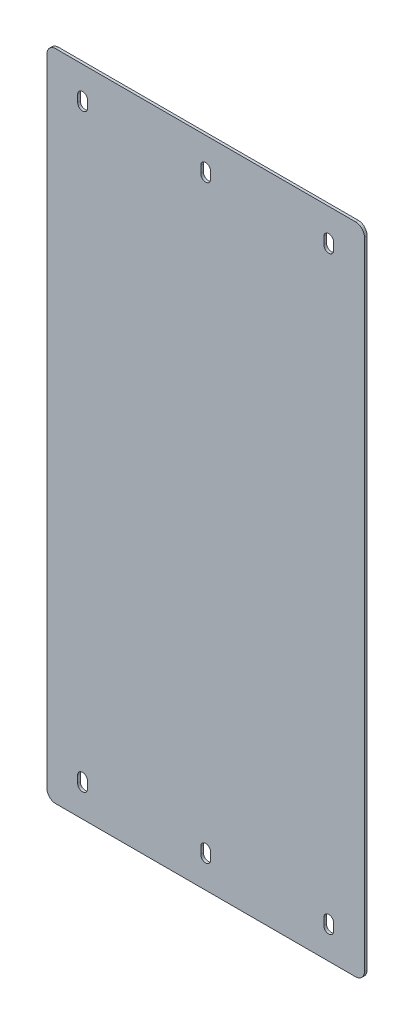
ISO-10303-21;
HEADER;
FILE_DESCRIPTION(('STEP AP214'),'2;1');
FILE_NAME('part.step','',(''),(''),'','','');
FILE_SCHEMA(('AUTOMOTIVE_DESIGN { 1 0 10303 214 1 1 1 1 }'));
ENDSEC;
DATA;
#1=APPLICATION_CONTEXT('core data for automotive mechanical design processes');
#2=APPLICATION_PROTOCOL_DEFINITION('international standard','automotive_design',2000,#1);
#3=PRODUCT_CONTEXT('',#1,'mechanical');
#4=PRODUCT('Part','Part','',(#3));
#5=PRODUCT_RELATED_PRODUCT_CATEGORY('part','',(#4));
#6=PRODUCT_DEFINITION_FORMATION('','',#4);
#7=PRODUCT_DEFINITION_CONTEXT('part definition',#1,'design');
#8=PRODUCT_DEFINITION('design','',#6,#7);
#9=PRODUCT_DEFINITION_SHAPE('','',#8);
#10=(LENGTH_UNIT() NAMED_UNIT(*) SI_UNIT(.MILLI.,.METRE.));
#11=(NAMED_UNIT(*) PLANE_ANGLE_UNIT() SI_UNIT($,.RADIAN.));
#12=(NAMED_UNIT(*) SI_UNIT($,.STERADIAN.) SOLID_ANGLE_UNIT());
#13=UNCERTAINTY_MEASURE_WITH_UNIT(LENGTH_MEASURE(1.E-05),#10,'distance_accuracy_value','');
#14=(GEOMETRIC_REPRESENTATION_CONTEXT(3) GLOBAL_UNCERTAINTY_ASSIGNED_CONTEXT((#13)) GLOBAL_UNIT_ASSIGNED_CONTEXT((#10,
#11,#12)) REPRESENTATION_CONTEXT('',''));
#15=CARTESIAN_POINT('',(0.,0.,0.));
#16=DIRECTION('',(0.,0.,1.));
#17=DIRECTION('',(1.,0.,0.));
#18=AXIS2_PLACEMENT_3D('',#15,#16,#17);
#19=CARTESIAN_POINT('',(-89.,-183.25,1.5));
#20=DIRECTION('',(1.,0.,0.));
#21=DIRECTION('',(0.,-1.,0.));
#22=AXIS2_PLACEMENT_3D('',#19,#20,#21);
#23=PLANE('',#22);
#24=DIRECTION('',(0.,1.,0.));
#25=VECTOR('',#24,1.);
#26=CARTESIAN_POINT('',(-89.,0.,0.));
#27=LINE('',#26,#25);
#28=CARTESIAN_POINT('',(-89.,178.25,0.));
#29=VERTEX_POINT('',#28);
#30=CARTESIAN_POINT('',(-89.,-178.25,0.));
#31=VERTEX_POINT('',#30);
#32=EDGE_CURVE('E468',#29,#31,#27,.F.);
#33=ORIENTED_EDGE('',*,*,#32,.T.);
#34=DIRECTION('',(0.,0.,-1.));
#35=VECTOR('',#34,1.);
#36=CARTESIAN_POINT('',(-89.,-178.25,1.5));
#37=LINE('',#36,#35);
#38=CARTESIAN_POINT('',(-89.,-178.25,1.5));
#39=VERTEX_POINT('',#38);
#40=EDGE_CURVE('E500',#31,#39,#37,.F.);
#41=ORIENTED_EDGE('',*,*,#40,.T.);
#42=DIRECTION('',(0.,-1.,0.));
#43=VECTOR('',#42,1.);
#44=CARTESIAN_POINT('',(-89.,-183.25,1.5));
#45=LINE('',#44,#43);
#46=CARTESIAN_POINT('',(-89.,178.25,1.5));
#47=VERTEX_POINT('',#46);
#48=EDGE_CURVE('E456',#47,#39,#45,.T.);
#49=ORIENTED_EDGE('',*,*,#48,.F.);
#50=DIRECTION('',(0.,0.,-1.));
#51=VECTOR('',#50,1.);
#52=CARTESIAN_POINT('',(-89.,178.25,1.5));
#53=LINE('',#52,#51);
#54=EDGE_CURVE('E498',#47,#29,#53,.T.);
#55=ORIENTED_EDGE('',*,*,#54,.T.);
#56=EDGE_LOOP('',(#33,#41,#49,#55));
#57=FACE_BOUND('',#56,.T.);
#58=ADVANCED_FACE('F36',(#57),#23,.F.);
#59=CARTESIAN_POINT('',(-89.,-183.25,1.5));
#60=DIRECTION('',(0.,1.,0.));
#61=DIRECTION('',(1.,0.,0.));
#62=AXIS2_PLACEMENT_3D('',#59,#60,#61);
#63=PLANE('',#62);
#64=DIRECTION('',(-1.,0.,0.));
#65=VECTOR('',#64,1.);
#66=CARTESIAN_POINT('',(0.,-183.25,0.));
#67=LINE('',#66,#65);
#68=CARTESIAN_POINT('',(-84.,-183.25,0.));
#69=VERTEX_POINT('',#68);
#70=CARTESIAN_POINT('',(84.,-183.25,0.));
#71=VERTEX_POINT('',#70);
#72=EDGE_CURVE('E453',#69,#71,#67,.F.);
#73=ORIENTED_EDGE('',*,*,#72,.T.);
#74=DIRECTION('',(0.,0.,-1.));
#75=VECTOR('',#74,1.);
#76=CARTESIAN_POINT('',(84.,-183.25,1.5));
#77=LINE('',#76,#75);
#78=CARTESIAN_POINT('',(84.,-183.25,1.5));
#79=VERTEX_POINT('',#78);
#80=EDGE_CURVE('E474',#71,#79,#77,.F.);
#81=ORIENTED_EDGE('',*,*,#80,.T.);
#82=DIRECTION('',(1.,0.,0.));
#83=VECTOR('',#82,1.);
#84=CARTESIAN_POINT('',(-89.,-183.25,1.5));
#85=LINE('',#84,#83);
#86=CARTESIAN_POINT('',(-84.,-183.25,1.5));
#87=VERTEX_POINT('',#86);
#88=EDGE_CURVE('E459',#87,#79,#85,.T.);
#89=ORIENTED_EDGE('',*,*,#88,.F.);
#90=DIRECTION('',(0.,0.,-1.));
#91=VECTOR('',#90,1.);
#92=CARTESIAN_POINT('',(-84.,-183.25,1.5));
#93=LINE('',#92,#91);
#94=EDGE_CURVE('E462',#87,#69,#93,.T.);
#95=ORIENTED_EDGE('',*,*,#94,.T.);
#96=EDGE_LOOP('',(#73,#81,#89,#95));
#97=FACE_BOUND('',#96,.T.);
#98=ADVANCED_FACE('F527',(#97),#63,.F.);
#99=CARTESIAN_POINT('',(89.,-183.25,1.5));
#100=DIRECTION('',(-1.,0.,0.));
#101=DIRECTION('',(0.,1.,0.));
#102=AXIS2_PLACEMENT_3D('',#99,#100,#101);
#103=PLANE('',#102);
#104=DIRECTION('',(0.,1.,0.));
#105=VECTOR('',#104,1.);
#106=CARTESIAN_POINT('',(89.,-183.25,1.5));
#107=LINE('',#106,#105);
#108=CARTESIAN_POINT('',(89.,-178.25,1.5));
#109=VERTEX_POINT('',#108);
#110=CARTESIAN_POINT('',(89.,178.25,1.5));
#111=VERTEX_POINT('',#110);
#112=EDGE_CURVE('E449',#109,#111,#107,.T.);
#113=ORIENTED_EDGE('',*,*,#112,.F.);
#114=DIRECTION('',(0.,0.,-1.));
#115=VECTOR('',#114,1.);
#116=CARTESIAN_POINT('',(89.,-178.25,1.5));
#117=LINE('',#116,#115);
#118=CARTESIAN_POINT('',(89.,-178.25,0.));
#119=VERTEX_POINT('',#118);
#120=EDGE_CURVE('E488',#109,#119,#117,.T.);
#121=ORIENTED_EDGE('',*,*,#120,.T.);
#122=DIRECTION('',(0.,1.,0.));
#123=VECTOR('',#122,1.);
#124=CARTESIAN_POINT('',(89.,0.,0.));
#125=LINE('',#124,#123);
#126=CARTESIAN_POINT('',(89.,178.25,0.));
#127=VERTEX_POINT('',#126);
#128=EDGE_CURVE('E440',#119,#127,#125,.T.);
#129=ORIENTED_EDGE('',*,*,#128,.T.);
#130=DIRECTION('',(0.,0.,-1.));
#131=VECTOR('',#130,1.);
#132=CARTESIAN_POINT('',(89.,178.25,1.5));
#133=LINE('',#132,#131);
#134=EDGE_CURVE('E485',#127,#111,#133,.F.);
#135=ORIENTED_EDGE('',*,*,#134,.T.);
#136=EDGE_LOOP('',(#113,#121,#129,#135));
#137=FACE_BOUND('',#136,.T.);
#138=ADVANCED_FACE('F517',(#137),#103,.F.);
#139=CARTESIAN_POINT('',(-89.,183.25,1.5));
#140=DIRECTION('',(0.,-1.,0.));
#141=DIRECTION('',(-1.,0.,0.));
#142=AXIS2_PLACEMENT_3D('',#139,#140,#141);
#143=PLANE('',#142);
#144=DIRECTION('',(-1.,0.,0.));
#145=VECTOR('',#144,1.);
#146=CARTESIAN_POINT('',(0.,183.25,0.));
#147=LINE('',#146,#145);
#148=CARTESIAN_POINT('',(84.,183.25,0.));
#149=VERTEX_POINT('',#148);
#150=CARTESIAN_POINT('',(-84.,183.25,0.));
#151=VERTEX_POINT('',#150);
#152=EDGE_CURVE('E465',#149,#151,#147,.T.);
#153=ORIENTED_EDGE('',*,*,#152,.T.);
#154=DIRECTION('',(0.,0.,-1.));
#155=VECTOR('',#154,1.);
#156=CARTESIAN_POINT('',(-84.,183.25,1.5));
#157=LINE('',#156,#155);
#158=CARTESIAN_POINT('',(-84.,183.25,1.5));
#159=VERTEX_POINT('',#158);
#160=EDGE_CURVE('E11',#151,#159,#157,.F.);
#161=ORIENTED_EDGE('',*,*,#160,.T.);
#162=DIRECTION('',(-1.,0.,0.));
#163=VECTOR('',#162,1.);
#164=CARTESIAN_POINT('',(-89.,183.25,1.5));
#165=LINE('',#164,#163);
#166=CARTESIAN_POINT('',(84.,183.25,1.5));
#167=VERTEX_POINT('',#166);
#168=EDGE_CURVE('E452',#167,#159,#165,.T.);
#169=ORIENTED_EDGE('',*,*,#168,.F.);
#170=DIRECTION('',(0.,0.,-1.));
#171=VECTOR('',#170,1.);
#172=CARTESIAN_POINT('',(84.,183.25,1.5));
#173=LINE('',#172,#171);
#174=EDGE_CURVE('E44',#167,#149,#173,.T.);
#175=ORIENTED_EDGE('',*,*,#174,.T.);
#176=EDGE_LOOP('',(#153,#161,#169,#175));
#177=FACE_BOUND('',#176,.T.);
#178=ADVANCED_FACE('F506',(#177),#143,.F.);
#179=CARTESIAN_POINT('',(0.,0.,1.5));
#180=DIRECTION('',(0.,0.,-1.));
#181=DIRECTION('',(-1.,0.,0.));
#182=AXIS2_PLACEMENT_3D('',#179,#180,#181);
#183=PLANE('',#182);
#184=DIRECTION('',(0.,1.,0.));
#185=VECTOR('',#184,1.);
#186=CARTESIAN_POINT('',(-66.25,163.25,1.5));
#187=LINE('',#186,#185);
#188=CARTESIAN_POINT('',(-66.25,163.25,1.5));
#189=VERTEX_POINT('',#188);
#190=CARTESIAN_POINT('',(-66.25,167.25,1.5));
#191=VERTEX_POINT('',#190);
#192=EDGE_CURVE('E431',#189,#191,#187,.T.);
#193=ORIENTED_EDGE('',*,*,#192,.F.);
#194=CARTESIAN_POINT('',(-69.,163.25,1.5));
#195=DIRECTION('',(0.,0.,1.));
#196=DIRECTION('',(1.,0.,0.));
#197=AXIS2_PLACEMENT_3D('',#194,#195,#196);
#198=CIRCLE('',#197,2.75000000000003);
#199=CARTESIAN_POINT('',(-71.75,163.25,1.5));
#200=VERTEX_POINT('',#199);
#201=EDGE_CURVE('E283',#200,#189,#198,.T.);
#202=ORIENTED_EDGE('',*,*,#201,.F.);
#203=DIRECTION('',(0.,-1.,0.));
#204=VECTOR('',#203,1.);
#205=CARTESIAN_POINT('',(-71.75,163.25,1.5));
#206=LINE('',#205,#204);
#207=CARTESIAN_POINT('',(-71.75,167.25,1.5));
#208=VERTEX_POINT('',#207);
#209=EDGE_CURVE('E420',#208,#200,#206,.T.);
#210=ORIENTED_EDGE('',*,*,#209,.F.);
#211=CARTESIAN_POINT('',(-69.,167.25,1.5));
#212=DIRECTION('',(0.,0.,1.));
#213=DIRECTION('',(1.,0.,0.));
#214=AXIS2_PLACEMENT_3D('',#211,#212,#213);
#215=CIRCLE('',#214,2.75000000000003);
#216=EDGE_CURVE('E433',#191,#208,#215,.T.);
#217=ORIENTED_EDGE('',*,*,#216,.F.);
#218=EDGE_LOOP('',(#193,#202,#210,#217));
#219=FACE_BOUND('',#218,.T.);
#220=DIRECTION('',(0.,1.,0.));
#221=VECTOR('',#220,1.);
#222=CARTESIAN_POINT('',(2.75000000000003,163.25,1.5));
#223=LINE('',#222,#221);
#224=CARTESIAN_POINT('',(2.75000000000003,163.25,1.5));
#225=VERTEX_POINT('',#224);
#226=CARTESIAN_POINT('',(2.75000000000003,167.25,1.5));
#227=VERTEX_POINT('',#226);
#228=EDGE_CURVE('E276',#225,#227,#223,.T.);
#229=ORIENTED_EDGE('',*,*,#228,.F.);
#230=CARTESIAN_POINT('',(0.,163.25,1.5));
#231=DIRECTION('',(0.,0.,1.));
#232=DIRECTION('',(1.,0.,0.));
#233=AXIS2_PLACEMENT_3D('',#230,#231,#232);
#234=CIRCLE('',#233,2.75000000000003);
#235=CARTESIAN_POINT('',(-2.75000000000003,163.25,1.5));
#236=VERTEX_POINT('',#235);
#237=EDGE_CURVE('E51',#236,#225,#234,.T.);
#238=ORIENTED_EDGE('',*,*,#237,.F.);
#239=DIRECTION('',(0.,-1.,0.));
#240=VECTOR('',#239,1.);
#241=CARTESIAN_POINT('',(-2.75000000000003,163.25,1.5));
#242=LINE('',#241,#240);
#243=CARTESIAN_POINT('',(-2.75000000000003,167.25,1.5));
#244=VERTEX_POINT('',#243);
#245=EDGE_CURVE('E268',#244,#236,#242,.T.);
#246=ORIENTED_EDGE('',*,*,#245,.F.);
#247=CARTESIAN_POINT('',(0.,167.25,1.5));
#248=DIRECTION('',(0.,0.,1.));
#249=DIRECTION('',(1.,0.,0.));
#250=AXIS2_PLACEMENT_3D('',#247,#248,#249);
#251=CIRCLE('',#250,2.75000000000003);
#252=EDGE_CURVE('E270',#227,#244,#251,.T.);
#253=ORIENTED_EDGE('',*,*,#252,.F.);
#254=EDGE_LOOP('',(#229,#238,#246,#253));
#255=FACE_BOUND('',#254,.T.);
#256=DIRECTION('',(0.,1.,0.));
#257=VECTOR('',#256,1.);
#258=CARTESIAN_POINT('',(71.75,163.25,1.5));
#259=LINE('',#258,#257);
#260=CARTESIAN_POINT('',(71.75,163.25,1.5));
#261=VERTEX_POINT('',#260);
#262=CARTESIAN_POINT('',(71.75,167.25,1.5));
#263=VERTEX_POINT('',#262);
#264=EDGE_CURVE('E303',#261,#263,#259,.T.);
#265=ORIENTED_EDGE('',*,*,#264,.F.);
#266=CARTESIAN_POINT('',(69.,163.25,1.5));
#267=DIRECTION('',(0.,0.,1.));
#268=DIRECTION('',(1.,0.,0.));
#269=AXIS2_PLACEMENT_3D('',#266,#267,#268);
#270=CIRCLE('',#269,2.74999999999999);
#271=CARTESIAN_POINT('',(66.25,163.25,1.5));
#272=VERTEX_POINT('',#271);
#273=EDGE_CURVE('E59',#272,#261,#270,.T.);
#274=ORIENTED_EDGE('',*,*,#273,.F.);
#275=DIRECTION('',(0.,-1.,0.));
#276=VECTOR('',#275,1.);
#277=CARTESIAN_POINT('',(66.25,163.25,1.5));
#278=LINE('',#277,#276);
#279=CARTESIAN_POINT('',(66.25,167.25,1.5));
#280=VERTEX_POINT('',#279);
#281=EDGE_CURVE('E292',#280,#272,#278,.T.);
#282=ORIENTED_EDGE('',*,*,#281,.F.);
#283=CARTESIAN_POINT('',(69.,167.25,1.5));
#284=DIRECTION('',(0.,0.,1.));
#285=DIRECTION('',(1.,0.,0.));
#286=AXIS2_PLACEMENT_3D('',#283,#284,#285);
#287=CIRCLE('',#286,2.74999999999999);
#288=EDGE_CURVE('E306',#263,#280,#287,.T.);
#289=ORIENTED_EDGE('',*,*,#288,.F.);
#290=EDGE_LOOP('',(#265,#274,#282,#289));
#291=FACE_BOUND('',#290,.T.);
#292=DIRECTION('',(0.,-1.,0.));
#293=VECTOR('',#292,1.);
#294=CARTESIAN_POINT('',(-2.75000000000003,-163.25,1.5));
#295=LINE('',#294,#293);
#296=CARTESIAN_POINT('',(-2.75000000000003,-163.25,1.5));
#297=VERTEX_POINT('',#296);
#298=CARTESIAN_POINT('',(-2.75000000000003,-167.25,1.5));
#299=VERTEX_POINT('',#298);
#300=EDGE_CURVE('E368',#297,#299,#295,.T.);
#301=ORIENTED_EDGE('',*,*,#300,.F.);
#302=CARTESIAN_POINT('',(0.,-163.25,1.5));
#303=DIRECTION('',(0.,0.,1.));
#304=DIRECTION('',(-1.,0.,0.));
#305=AXIS2_PLACEMENT_3D('',#302,#303,#304);
#306=CIRCLE('',#305,2.75000000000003);
#307=CARTESIAN_POINT('',(2.75000000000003,-163.25,1.5));
#308=VERTEX_POINT('',#307);
#309=EDGE_CURVE('E365',#308,#297,#306,.T.);
#310=ORIENTED_EDGE('',*,*,#309,.F.);
#311=DIRECTION('',(0.,1.,0.));
#312=VECTOR('',#311,1.);
#313=CARTESIAN_POINT('',(2.75000000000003,-163.25,1.5));
#314=LINE('',#313,#312);
#315=CARTESIAN_POINT('',(2.75000000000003,-167.25,1.5));
#316=VERTEX_POINT('',#315);
#317=EDGE_CURVE('E355',#316,#308,#314,.T.);
#318=ORIENTED_EDGE('',*,*,#317,.F.);
#319=CARTESIAN_POINT('',(0.,-167.25,1.5));
#320=DIRECTION('',(0.,0.,1.));
#321=DIRECTION('',(-1.,0.,0.));
#322=AXIS2_PLACEMENT_3D('',#319,#320,#321);
#323=CIRCLE('',#322,2.75000000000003);
#324=EDGE_CURVE('E371',#299,#316,#323,.T.);
#325=ORIENTED_EDGE('',*,*,#324,.F.);
#326=EDGE_LOOP('',(#301,#310,#318,#325));
#327=FACE_BOUND('',#326,.T.);
#328=DIRECTION('',(0.,-1.,0.));
#329=VECTOR('',#328,1.);
#330=CARTESIAN_POINT('',(-71.75,-163.25,1.5));
#331=LINE('',#330,#329);
#332=CARTESIAN_POINT('',(-71.75,-163.25,1.5));
#333=VERTEX_POINT('',#332);
#334=CARTESIAN_POINT('',(-71.75,-167.25,1.5));
#335=VERTEX_POINT('',#334);
#336=EDGE_CURVE('E335',#333,#335,#331,.T.);
#337=ORIENTED_EDGE('',*,*,#336,.F.);
#338=CARTESIAN_POINT('',(-69.,-163.25,1.5));
#339=DIRECTION('',(0.,0.,1.));
#340=DIRECTION('',(-1.,0.,0.));
#341=AXIS2_PLACEMENT_3D('',#338,#339,#340);
#342=CIRCLE('',#341,2.75000000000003);
#343=CARTESIAN_POINT('',(-66.25,-163.25,1.5));
#344=VERTEX_POINT('',#343);
#345=EDGE_CURVE('E332',#344,#333,#342,.T.);
#346=ORIENTED_EDGE('',*,*,#345,.F.);
#347=DIRECTION('',(0.,1.,0.));
#348=VECTOR('',#347,1.);
#349=CARTESIAN_POINT('',(-66.25,-163.25,1.5));
#350=LINE('',#349,#348);
#351=CARTESIAN_POINT('',(-66.25,-167.25,1.5));
#352=VERTEX_POINT('',#351);
#353=EDGE_CURVE('E322',#352,#344,#350,.T.);
#354=ORIENTED_EDGE('',*,*,#353,.F.);
#355=CARTESIAN_POINT('',(-69.,-167.25,1.5));
#356=DIRECTION('',(0.,0.,1.));
#357=DIRECTION('',(-1.,0.,0.));
#358=AXIS2_PLACEMENT_3D('',#355,#356,#357);
#359=CIRCLE('',#358,2.75000000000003);
#360=EDGE_CURVE('E338',#335,#352,#359,.T.);
#361=ORIENTED_EDGE('',*,*,#360,.F.);
#362=EDGE_LOOP('',(#337,#346,#354,#361));
#363=FACE_BOUND('',#362,.T.);
#364=DIRECTION('',(0.,-1.,0.));
#365=VECTOR('',#364,1.);
#366=CARTESIAN_POINT('',(66.25,-163.25,1.5));
#367=LINE('',#366,#365);
#368=CARTESIAN_POINT('',(66.25,-163.25,1.5));
#369=VERTEX_POINT('',#368);
#370=CARTESIAN_POINT('',(66.25,-167.25,1.5));
#371=VERTEX_POINT('',#370);
#372=EDGE_CURVE('E401',#369,#371,#367,.T.);
#373=ORIENTED_EDGE('',*,*,#372,.F.);
#374=CARTESIAN_POINT('',(69.,-163.25,1.5));
#375=DIRECTION('',(0.,0.,1.));
#376=DIRECTION('',(-1.,0.,0.));
#377=AXIS2_PLACEMENT_3D('',#374,#375,#376);
#378=CIRCLE('',#377,2.74999999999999);
#379=CARTESIAN_POINT('',(71.75,-163.25,1.5));
#380=VERTEX_POINT('',#379);
#381=EDGE_CURVE('E398',#380,#369,#378,.T.);
#382=ORIENTED_EDGE('',*,*,#381,.F.);
#383=DIRECTION('',(0.,1.,0.));
#384=VECTOR('',#383,1.);
#385=CARTESIAN_POINT('',(71.75,-163.25,1.5));
#386=LINE('',#385,#384);
#387=CARTESIAN_POINT('',(71.75,-167.25,1.5));
#388=VERTEX_POINT('',#387);
#389=EDGE_CURVE('E388',#388,#380,#386,.T.);
#390=ORIENTED_EDGE('',*,*,#389,.F.);
#391=CARTESIAN_POINT('',(69.,-167.25,1.5));
#392=DIRECTION('',(0.,0.,1.));
#393=DIRECTION('',(-1.,0.,0.));
#394=AXIS2_PLACEMENT_3D('',#391,#392,#393);
#395=CIRCLE('',#394,2.74999999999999);
#396=EDGE_CURVE('E403',#371,#388,#395,.T.);
#397=ORIENTED_EDGE('',*,*,#396,.F.);
#398=EDGE_LOOP('',(#373,#382,#390,#397));
#399=FACE_BOUND('',#398,.T.);
#400=ORIENTED_EDGE('',*,*,#88,.T.);
#401=CARTESIAN_POINT('',(84.,-178.25,1.5));
#402=DIRECTION('',(0.,0.,-1.));
#403=DIRECTION('',(-1.,0.,0.));
#404=AXIS2_PLACEMENT_3D('',#401,#402,#403);
#405=CIRCLE('',#404,5.);
#406=EDGE_CURVE('E483',#79,#109,#405,.F.);
#407=ORIENTED_EDGE('',*,*,#406,.T.);
#408=ORIENTED_EDGE('',*,*,#112,.T.);
#409=CARTESIAN_POINT('',(84.,178.25,1.5));
#410=DIRECTION('',(0.,0.,-1.));
#411=DIRECTION('',(-1.,0.,0.));
#412=AXIS2_PLACEMENT_3D('',#409,#410,#411);
#413=CIRCLE('',#412,5.);
#414=EDGE_CURVE('E477',#111,#167,#413,.F.);
#415=ORIENTED_EDGE('',*,*,#414,.T.);
#416=ORIENTED_EDGE('',*,*,#168,.T.);
#417=CARTESIAN_POINT('',(-84.,178.25,1.5));
#418=DIRECTION('',(0.,0.,-1.));
#419=DIRECTION('',(-1.,0.,0.));
#420=AXIS2_PLACEMENT_3D('',#417,#418,#419);
#421=CIRCLE('',#420,5.);
#422=EDGE_CURVE('E479',#159,#47,#421,.F.);
#423=ORIENTED_EDGE('',*,*,#422,.T.);
#424=ORIENTED_EDGE('',*,*,#48,.T.);
#425=CARTESIAN_POINT('',(-84.,-178.25,1.5));
#426=DIRECTION('',(0.,0.,-1.));
#427=DIRECTION('',(-1.,0.,0.));
#428=AXIS2_PLACEMENT_3D('',#425,#426,#427);
#429=CIRCLE('',#428,5.);
#430=EDGE_CURVE('E481',#39,#87,#429,.F.);
#431=ORIENTED_EDGE('',*,*,#430,.T.);
#432=EDGE_LOOP('',(#400,#407,#408,#415,#416,#423,#424,#431));
#433=FACE_BOUND('',#432,.T.);
#434=ADVANCED_FACE('F520',(#219,#255,#291,#327,#363,#399,#433),#183,.F.);
#435=CARTESIAN_POINT('',(0.,0.,0.));
#436=DIRECTION('',(0.,0.,-1.));
#437=DIRECTION('',(-1.,0.,0.));
#438=AXIS2_PLACEMENT_3D('',#435,#436,#437);
#439=PLANE('',#438);
#440=CARTESIAN_POINT('',(0.,163.25,0.));
#441=DIRECTION('',(0.,0.,1.));
#442=DIRECTION('',(1.,0.,0.));
#443=AXIS2_PLACEMENT_3D('',#440,#441,#442);
#444=CIRCLE('',#443,2.75000000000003);
#445=CARTESIAN_POINT('',(-2.75000000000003,163.25,0.));
#446=VERTEX_POINT('',#445);
#447=CARTESIAN_POINT('',(2.75000000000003,163.25,0.));
#448=VERTEX_POINT('',#447);
#449=EDGE_CURVE('E259',#446,#448,#444,.T.);
#450=ORIENTED_EDGE('',*,*,#449,.T.);
#451=DIRECTION('',(0.,1.,0.));
#452=VECTOR('',#451,1.);
#453=CARTESIAN_POINT('',(2.75000000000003,163.25,0.));
#454=LINE('',#453,#452);
#455=CARTESIAN_POINT('',(2.75000000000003,167.25,0.));
#456=VERTEX_POINT('',#455);
#457=EDGE_CURVE('E248',#448,#456,#454,.T.);
#458=ORIENTED_EDGE('',*,*,#457,.T.);
#459=CARTESIAN_POINT('',(0.,167.25,0.));
#460=DIRECTION('',(0.,0.,1.));
#461=DIRECTION('',(1.,0.,0.));
#462=AXIS2_PLACEMENT_3D('',#459,#460,#461);
#463=CIRCLE('',#462,2.75000000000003);
#464=CARTESIAN_POINT('',(-2.75000000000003,167.25,0.));
#465=VERTEX_POINT('',#464);
#466=EDGE_CURVE('E258',#456,#465,#463,.T.);
#467=ORIENTED_EDGE('',*,*,#466,.T.);
#468=DIRECTION('',(0.,-1.,0.));
#469=VECTOR('',#468,1.);
#470=CARTESIAN_POINT('',(-2.75000000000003,163.25,0.));
#471=LINE('',#470,#469);
#472=EDGE_CURVE('E264',#465,#446,#471,.T.);
#473=ORIENTED_EDGE('',*,*,#472,.T.);
#474=EDGE_LOOP('',(#450,#458,#467,#473));
#475=FACE_BOUND('',#474,.T.);
#476=CARTESIAN_POINT('',(69.,163.25,0.));
#477=DIRECTION('',(0.,0.,1.));
#478=DIRECTION('',(1.,0.,0.));
#479=AXIS2_PLACEMENT_3D('',#476,#477,#478);
#480=CIRCLE('',#479,2.74999999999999);
#481=CARTESIAN_POINT('',(66.25,163.25,0.));
#482=VERTEX_POINT('',#481);
#483=CARTESIAN_POINT('',(71.75,163.25,0.));
#484=VERTEX_POINT('',#483);
#485=EDGE_CURVE('E288',#482,#484,#480,.T.);
#486=ORIENTED_EDGE('',*,*,#485,.T.);
#487=DIRECTION('',(0.,1.,0.));
#488=VECTOR('',#487,1.);
#489=CARTESIAN_POINT('',(71.75,163.25,0.));
#490=LINE('',#489,#488);
#491=CARTESIAN_POINT('',(71.75,167.25,0.));
#492=VERTEX_POINT('',#491);
#493=EDGE_CURVE('E291',#484,#492,#490,.T.);
#494=ORIENTED_EDGE('',*,*,#493,.T.);
#495=CARTESIAN_POINT('',(69.,167.25,0.));
#496=DIRECTION('',(0.,0.,1.));
#497=DIRECTION('',(1.,0.,0.));
#498=AXIS2_PLACEMENT_3D('',#495,#496,#497);
#499=CIRCLE('',#498,2.74999999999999);
#500=CARTESIAN_POINT('',(66.25,167.25,0.));
#501=VERTEX_POINT('',#500);
#502=EDGE_CURVE('E295',#492,#501,#499,.T.);
#503=ORIENTED_EDGE('',*,*,#502,.T.);
#504=DIRECTION('',(0.,-1.,0.));
#505=VECTOR('',#504,1.);
#506=CARTESIAN_POINT('',(66.25,163.25,0.));
#507=LINE('',#506,#505);
#508=EDGE_CURVE('E298',#501,#482,#507,.T.);
#509=ORIENTED_EDGE('',*,*,#508,.T.);
#510=EDGE_LOOP('',(#486,#494,#503,#509));
#511=FACE_BOUND('',#510,.T.);
#512=CARTESIAN_POINT('',(-69.,-163.25,0.));
#513=DIRECTION('',(0.,0.,1.));
#514=DIRECTION('',(-1.,0.,0.));
#515=AXIS2_PLACEMENT_3D('',#512,#513,#514);
#516=CIRCLE('',#515,2.75000000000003);
#517=CARTESIAN_POINT('',(-66.25,-163.25,0.));
#518=VERTEX_POINT('',#517);
#519=CARTESIAN_POINT('',(-71.75,-163.25,0.));
#520=VERTEX_POINT('',#519);
#521=EDGE_CURVE('E318',#518,#520,#516,.T.);
#522=ORIENTED_EDGE('',*,*,#521,.T.);
#523=DIRECTION('',(0.,-1.,0.));
#524=VECTOR('',#523,1.);
#525=CARTESIAN_POINT('',(-71.75,-163.25,0.));
#526=LINE('',#525,#524);
#527=CARTESIAN_POINT('',(-71.75,-167.25,0.));
#528=VERTEX_POINT('',#527);
#529=EDGE_CURVE('E321',#520,#528,#526,.T.);
#530=ORIENTED_EDGE('',*,*,#529,.T.);
#531=CARTESIAN_POINT('',(-69.,-167.25,0.));
#532=DIRECTION('',(0.,0.,1.));
#533=DIRECTION('',(-1.,0.,0.));
#534=AXIS2_PLACEMENT_3D('',#531,#532,#533);
#535=CIRCLE('',#534,2.75000000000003);
#536=CARTESIAN_POINT('',(-66.25,-167.25,0.));
#537=VERTEX_POINT('',#536);
#538=EDGE_CURVE('E325',#528,#537,#535,.T.);
#539=ORIENTED_EDGE('',*,*,#538,.T.);
#540=DIRECTION('',(0.,1.,0.));
#541=VECTOR('',#540,1.);
#542=CARTESIAN_POINT('',(-66.25,-163.25,0.));
#543=LINE('',#542,#541);
#544=EDGE_CURVE('E328',#537,#518,#543,.T.);
#545=ORIENTED_EDGE('',*,*,#544,.T.);
#546=EDGE_LOOP('',(#522,#530,#539,#545));
#547=FACE_BOUND('',#546,.T.);
#548=CARTESIAN_POINT('',(0.,-163.25,0.));
#549=DIRECTION('',(0.,0.,1.));
#550=DIRECTION('',(-1.,0.,0.));
#551=AXIS2_PLACEMENT_3D('',#548,#549,#550);
#552=CIRCLE('',#551,2.75000000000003);
#553=CARTESIAN_POINT('',(2.75000000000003,-163.25,0.));
#554=VERTEX_POINT('',#553);
#555=CARTESIAN_POINT('',(-2.75000000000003,-163.25,0.));
#556=VERTEX_POINT('',#555);
#557=EDGE_CURVE('E351',#554,#556,#552,.T.);
#558=ORIENTED_EDGE('',*,*,#557,.T.);
#559=DIRECTION('',(0.,-1.,0.));
#560=VECTOR('',#559,1.);
#561=CARTESIAN_POINT('',(-2.75000000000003,-163.25,0.));
#562=LINE('',#561,#560);
#563=CARTESIAN_POINT('',(-2.75000000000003,-167.25,0.));
#564=VERTEX_POINT('',#563);
#565=EDGE_CURVE('E354',#556,#564,#562,.T.);
#566=ORIENTED_EDGE('',*,*,#565,.T.);
#567=CARTESIAN_POINT('',(0.,-167.25,0.));
#568=DIRECTION('',(0.,0.,1.));
#569=DIRECTION('',(-1.,0.,0.));
#570=AXIS2_PLACEMENT_3D('',#567,#568,#569);
#571=CIRCLE('',#570,2.75000000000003);
#572=CARTESIAN_POINT('',(2.75000000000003,-167.25,0.));
#573=VERTEX_POINT('',#572);
#574=EDGE_CURVE('E358',#564,#573,#571,.T.);
#575=ORIENTED_EDGE('',*,*,#574,.T.);
#576=DIRECTION('',(0.,1.,0.));
#577=VECTOR('',#576,1.);
#578=CARTESIAN_POINT('',(2.75000000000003,-163.25,0.));
#579=LINE('',#578,#577);
#580=EDGE_CURVE('E361',#573,#554,#579,.T.);
#581=ORIENTED_EDGE('',*,*,#580,.T.);
#582=EDGE_LOOP('',(#558,#566,#575,#581));
#583=FACE_BOUND('',#582,.T.);
#584=CARTESIAN_POINT('',(69.,-163.25,0.));
#585=DIRECTION('',(0.,0.,1.));
#586=DIRECTION('',(-1.,0.,0.));
#587=AXIS2_PLACEMENT_3D('',#584,#585,#586);
#588=CIRCLE('',#587,2.74999999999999);
#589=CARTESIAN_POINT('',(71.75,-163.25,0.));
#590=VERTEX_POINT('',#589);
#591=CARTESIAN_POINT('',(66.25,-163.25,0.));
#592=VERTEX_POINT('',#591);
#593=EDGE_CURVE('E384',#590,#592,#588,.T.);
#594=ORIENTED_EDGE('',*,*,#593,.T.);
#595=DIRECTION('',(0.,-1.,0.));
#596=VECTOR('',#595,1.);
#597=CARTESIAN_POINT('',(66.25,-163.25,0.));
#598=LINE('',#597,#596);
#599=CARTESIAN_POINT('',(66.25,-167.25,0.));
#600=VERTEX_POINT('',#599);
#601=EDGE_CURVE('E387',#592,#600,#598,.T.);
#602=ORIENTED_EDGE('',*,*,#601,.T.);
#603=CARTESIAN_POINT('',(69.,-167.25,0.));
#604=DIRECTION('',(0.,0.,1.));
#605=DIRECTION('',(-1.,0.,0.));
#606=AXIS2_PLACEMENT_3D('',#603,#604,#605);
#607=CIRCLE('',#606,2.74999999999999);
#608=CARTESIAN_POINT('',(71.75,-167.25,0.));
#609=VERTEX_POINT('',#608);
#610=EDGE_CURVE('E391',#600,#609,#607,.T.);
#611=ORIENTED_EDGE('',*,*,#610,.T.);
#612=DIRECTION('',(0.,1.,0.));
#613=VECTOR('',#612,1.);
#614=CARTESIAN_POINT('',(71.75,-163.25,0.));
#615=LINE('',#614,#613);
#616=EDGE_CURVE('E394',#609,#590,#615,.T.);
#617=ORIENTED_EDGE('',*,*,#616,.T.);
#618=EDGE_LOOP('',(#594,#602,#611,#617));
#619=FACE_BOUND('',#618,.T.);
#620=CARTESIAN_POINT('',(-69.,163.25,0.));
#621=DIRECTION('',(0.,0.,1.));
#622=DIRECTION('',(1.,0.,0.));
#623=AXIS2_PLACEMENT_3D('',#620,#621,#622);
#624=CIRCLE('',#623,2.75000000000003);
#625=CARTESIAN_POINT('',(-71.75,163.25,0.));
#626=VERTEX_POINT('',#625);
#627=CARTESIAN_POINT('',(-66.25,163.25,0.));
#628=VERTEX_POINT('',#627);
#629=EDGE_CURVE('E416',#626,#628,#624,.T.);
#630=ORIENTED_EDGE('',*,*,#629,.T.);
#631=DIRECTION('',(0.,1.,0.));
#632=VECTOR('',#631,1.);
#633=CARTESIAN_POINT('',(-66.25,163.25,0.));
#634=LINE('',#633,#632);
#635=CARTESIAN_POINT('',(-66.25,167.25,0.));
#636=VERTEX_POINT('',#635);
#637=EDGE_CURVE('E419',#628,#636,#634,.T.);
#638=ORIENTED_EDGE('',*,*,#637,.T.);
#639=CARTESIAN_POINT('',(-69.,167.25,0.));
#640=DIRECTION('',(0.,0.,1.));
#641=DIRECTION('',(1.,0.,0.));
#642=AXIS2_PLACEMENT_3D('',#639,#640,#641);
#643=CIRCLE('',#642,2.75000000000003);
#644=CARTESIAN_POINT('',(-71.75,167.25,0.));
#645=VERTEX_POINT('',#644);
#646=EDGE_CURVE('E423',#636,#645,#643,.T.);
#647=ORIENTED_EDGE('',*,*,#646,.T.);
#648=DIRECTION('',(0.,-1.,0.));
#649=VECTOR('',#648,1.);
#650=CARTESIAN_POINT('',(-71.75,163.25,0.));
#651=LINE('',#650,#649);
#652=EDGE_CURVE('E426',#645,#626,#651,.T.);
#653=ORIENTED_EDGE('',*,*,#652,.T.);
#654=EDGE_LOOP('',(#630,#638,#647,#653));
#655=FACE_BOUND('',#654,.T.);
#656=ORIENTED_EDGE('',*,*,#128,.F.);
#657=CARTESIAN_POINT('',(84.,-178.25,0.));
#658=DIRECTION('',(0.,0.,-1.));
#659=DIRECTION('',(-1.,0.,0.));
#660=AXIS2_PLACEMENT_3D('',#657,#658,#659);
#661=CIRCLE('',#660,5.);
#662=EDGE_CURVE('E496',#119,#71,#661,.T.);
#663=ORIENTED_EDGE('',*,*,#662,.T.);
#664=ORIENTED_EDGE('',*,*,#72,.F.);
#665=CARTESIAN_POINT('',(-84.,-178.25,0.));
#666=DIRECTION('',(0.,0.,-1.));
#667=DIRECTION('',(-1.,0.,0.));
#668=AXIS2_PLACEMENT_3D('',#665,#666,#667);
#669=CIRCLE('',#668,5.);
#670=EDGE_CURVE('E494',#69,#31,#669,.T.);
#671=ORIENTED_EDGE('',*,*,#670,.T.);
#672=ORIENTED_EDGE('',*,*,#32,.F.);
#673=CARTESIAN_POINT('',(-84.,178.25,0.));
#674=DIRECTION('',(0.,0.,-1.));
#675=DIRECTION('',(-1.,0.,0.));
#676=AXIS2_PLACEMENT_3D('',#673,#674,#675);
#677=CIRCLE('',#676,5.);
#678=EDGE_CURVE('E492',#29,#151,#677,.T.);
#679=ORIENTED_EDGE('',*,*,#678,.T.);
#680=ORIENTED_EDGE('',*,*,#152,.F.);
#681=CARTESIAN_POINT('',(84.,178.25,0.));
#682=DIRECTION('',(0.,0.,-1.));
#683=DIRECTION('',(-1.,0.,0.));
#684=AXIS2_PLACEMENT_3D('',#681,#682,#683);
#685=CIRCLE('',#684,5.);
#686=EDGE_CURVE('E490',#149,#127,#685,.T.);
#687=ORIENTED_EDGE('',*,*,#686,.T.);
#688=EDGE_LOOP('',(#656,#663,#664,#671,#672,#679,#680,#687));
#689=FACE_BOUND('',#688,.T.);
#690=ADVANCED_FACE('F266',(#475,#511,#547,#583,#619,#655,#689),#439,.T.);
#691=CARTESIAN_POINT('',(84.,-178.25,1.5));
#692=DIRECTION('',(0.,0.,1.));
#693=DIRECTION('',(1.,0.,0.));
#694=AXIS2_PLACEMENT_3D('',#691,#692,#693);
#695=CYLINDRICAL_SURFACE('',#694,5.);
#696=ORIENTED_EDGE('',*,*,#662,.F.);
#697=ORIENTED_EDGE('',*,*,#120,.F.);
#698=ORIENTED_EDGE('',*,*,#406,.F.);
#699=ORIENTED_EDGE('',*,*,#80,.F.);
#700=EDGE_LOOP('',(#696,#697,#698,#699));
#701=FACE_BOUND('',#700,.T.);
#702=ADVANCED_FACE('F525',(#701),#695,.T.);
#703=CARTESIAN_POINT('',(-84.,-178.25,1.5));
#704=DIRECTION('',(0.,0.,1.));
#705=DIRECTION('',(1.,0.,0.));
#706=AXIS2_PLACEMENT_3D('',#703,#704,#705);
#707=CYLINDRICAL_SURFACE('',#706,5.);
#708=ORIENTED_EDGE('',*,*,#670,.F.);
#709=ORIENTED_EDGE('',*,*,#94,.F.);
#710=ORIENTED_EDGE('',*,*,#430,.F.);
#711=ORIENTED_EDGE('',*,*,#40,.F.);
#712=EDGE_LOOP('',(#708,#709,#710,#711));
#713=FACE_BOUND('',#712,.T.);
#714=ADVANCED_FACE('F533',(#713),#707,.T.);
#715=CARTESIAN_POINT('',(-84.,178.25,1.5));
#716=DIRECTION('',(0.,0.,1.));
#717=DIRECTION('',(1.,0.,0.));
#718=AXIS2_PLACEMENT_3D('',#715,#716,#717);
#719=CYLINDRICAL_SURFACE('',#718,5.);
#720=ORIENTED_EDGE('',*,*,#678,.F.);
#721=ORIENTED_EDGE('',*,*,#54,.F.);
#722=ORIENTED_EDGE('',*,*,#422,.F.);
#723=ORIENTED_EDGE('',*,*,#160,.F.);
#724=EDGE_LOOP('',(#720,#721,#722,#723));
#725=FACE_BOUND('',#724,.T.);
#726=ADVANCED_FACE('F538',(#725),#719,.T.);
#727=CARTESIAN_POINT('',(84.,178.25,1.5));
#728=DIRECTION('',(0.,0.,1.));
#729=DIRECTION('',(1.,0.,0.));
#730=AXIS2_PLACEMENT_3D('',#727,#728,#729);
#731=CYLINDRICAL_SURFACE('',#730,5.);
#732=ORIENTED_EDGE('',*,*,#686,.F.);
#733=ORIENTED_EDGE('',*,*,#174,.F.);
#734=ORIENTED_EDGE('',*,*,#414,.F.);
#735=ORIENTED_EDGE('',*,*,#134,.F.);
#736=EDGE_LOOP('',(#732,#733,#734,#735));
#737=FACE_BOUND('',#736,.T.);
#738=ADVANCED_FACE('F38',(#737),#731,.T.);
#739=CARTESIAN_POINT('',(-71.75,163.25,0.));
#740=DIRECTION('',(-1.,0.,0.));
#741=DIRECTION('',(0.,0.,1.));
#742=AXIS2_PLACEMENT_3D('',#739,#740,#741);
#743=PLANE('',#742);
#744=ORIENTED_EDGE('',*,*,#209,.T.);
#745=DIRECTION('',(0.,0.,1.));
#746=VECTOR('',#745,1.);
#747=CARTESIAN_POINT('',(-71.75,163.25,0.));
#748=LINE('',#747,#746);
#749=EDGE_CURVE('E437',#626,#200,#748,.T.);
#750=ORIENTED_EDGE('',*,*,#749,.F.);
#751=ORIENTED_EDGE('',*,*,#652,.F.);
#752=DIRECTION('',(0.,0.,1.));
#753=VECTOR('',#752,1.);
#754=CARTESIAN_POINT('',(-71.75,167.25,0.));
#755=LINE('',#754,#753);
#756=EDGE_CURVE('E441',#645,#208,#755,.T.);
#757=ORIENTED_EDGE('',*,*,#756,.T.);
#758=EDGE_LOOP('',(#744,#750,#751,#757));
#759=FACE_BOUND('',#758,.T.);
#760=ADVANCED_FACE('F544',(#759),#743,.F.);
#761=CARTESIAN_POINT('',(-66.25,163.25,0.));
#762=DIRECTION('',(1.,0.,0.));
#763=DIRECTION('',(0.,0.,-1.));
#764=AXIS2_PLACEMENT_3D('',#761,#762,#763);
#765=PLANE('',#764);
#766=ORIENTED_EDGE('',*,*,#192,.T.);
#767=DIRECTION('',(0.,0.,1.));
#768=VECTOR('',#767,1.);
#769=CARTESIAN_POINT('',(-66.25,167.25,0.));
#770=LINE('',#769,#768);
#771=EDGE_CURVE('E444',#636,#191,#770,.T.);
#772=ORIENTED_EDGE('',*,*,#771,.F.);
#773=ORIENTED_EDGE('',*,*,#637,.F.);
#774=DIRECTION('',(0.,0.,1.));
#775=VECTOR('',#774,1.);
#776=CARTESIAN_POINT('',(-66.25,163.25,0.));
#777=LINE('',#776,#775);
#778=EDGE_CURVE('E429',#628,#189,#777,.T.);
#779=ORIENTED_EDGE('',*,*,#778,.T.);
#780=EDGE_LOOP('',(#766,#772,#773,#779));
#781=FACE_BOUND('',#780,.T.);
#782=ADVANCED_FACE('F599',(#781),#765,.F.);
#783=CARTESIAN_POINT('',(-69.,163.25,0.));
#784=DIRECTION('',(0.,0.,1.));
#785=DIRECTION('',(1.,0.,0.));
#786=AXIS2_PLACEMENT_3D('',#783,#784,#785);
#787=CYLINDRICAL_SURFACE('',#786,2.75000000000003);
#788=ORIENTED_EDGE('',*,*,#201,.T.);
#789=ORIENTED_EDGE('',*,*,#778,.F.);
#790=ORIENTED_EDGE('',*,*,#629,.F.);
#791=ORIENTED_EDGE('',*,*,#749,.T.);
#792=EDGE_LOOP('',(#788,#789,#790,#791));
#793=FACE_BOUND('',#792,.T.);
#794=ADVANCED_FACE('F610',(#793),#787,.F.);
#795=CARTESIAN_POINT('',(-69.,167.25,0.));
#796=DIRECTION('',(0.,0.,1.));
#797=DIRECTION('',(1.,0.,0.));
#798=AXIS2_PLACEMENT_3D('',#795,#796,#797);
#799=CYLINDRICAL_SURFACE('',#798,2.75000000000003);
#800=ORIENTED_EDGE('',*,*,#216,.T.);
#801=ORIENTED_EDGE('',*,*,#756,.F.);
#802=ORIENTED_EDGE('',*,*,#646,.F.);
#803=ORIENTED_EDGE('',*,*,#771,.T.);
#804=EDGE_LOOP('',(#800,#801,#802,#803));
#805=FACE_BOUND('',#804,.T.);
#806=ADVANCED_FACE('F620',(#805),#799,.F.);
#807=CARTESIAN_POINT('',(71.75,-163.25,0.));
#808=DIRECTION('',(1.,0.,0.));
#809=DIRECTION('',(0.,0.,-1.));
#810=AXIS2_PLACEMENT_3D('',#807,#808,#809);
#811=PLANE('',#810);
#812=ORIENTED_EDGE('',*,*,#389,.T.);
#813=DIRECTION('',(0.,0.,1.));
#814=VECTOR('',#813,1.);
#815=CARTESIAN_POINT('',(71.75,-163.25,0.));
#816=LINE('',#815,#814);
#817=EDGE_CURVE('E369',#590,#380,#816,.T.);
#818=ORIENTED_EDGE('',*,*,#817,.F.);
#819=ORIENTED_EDGE('',*,*,#616,.F.);
#820=DIRECTION('',(0.,0.,1.));
#821=VECTOR('',#820,1.);
#822=CARTESIAN_POINT('',(71.75,-167.25,0.));
#823=LINE('',#822,#821);
#824=EDGE_CURVE('E409',#609,#388,#823,.T.);
#825=ORIENTED_EDGE('',*,*,#824,.T.);
#826=EDGE_LOOP('',(#812,#818,#819,#825));
#827=FACE_BOUND('',#826,.T.);
#828=ADVANCED_FACE('F630',(#827),#811,.F.);
#829=CARTESIAN_POINT('',(66.25,-163.25,0.));
#830=DIRECTION('',(-1.,0.,0.));
#831=DIRECTION('',(0.,0.,1.));
#832=AXIS2_PLACEMENT_3D('',#829,#830,#831);
#833=PLANE('',#832);
#834=ORIENTED_EDGE('',*,*,#372,.T.);
#835=DIRECTION('',(0.,0.,1.));
#836=VECTOR('',#835,1.);
#837=CARTESIAN_POINT('',(66.25,-167.25,0.));
#838=LINE('',#837,#836);
#839=EDGE_CURVE('E411',#600,#371,#838,.T.);
#840=ORIENTED_EDGE('',*,*,#839,.F.);
#841=ORIENTED_EDGE('',*,*,#601,.F.);
#842=DIRECTION('',(0.,0.,1.));
#843=VECTOR('',#842,1.);
#844=CARTESIAN_POINT('',(66.25,-163.25,0.));
#845=LINE('',#844,#843);
#846=EDGE_CURVE('E397',#592,#369,#845,.T.);
#847=ORIENTED_EDGE('',*,*,#846,.T.);
#848=EDGE_LOOP('',(#834,#840,#841,#847));
#849=FACE_BOUND('',#848,.T.);
#850=ADVANCED_FACE('F642',(#849),#833,.F.);
#851=CARTESIAN_POINT('',(69.,-163.25,0.));
#852=DIRECTION('',(0.,0.,1.));
#853=DIRECTION('',(1.,0.,0.));
#854=AXIS2_PLACEMENT_3D('',#851,#852,#853);
#855=CYLINDRICAL_SURFACE('',#854,2.74999999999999);
#856=ORIENTED_EDGE('',*,*,#381,.T.);
#857=ORIENTED_EDGE('',*,*,#846,.F.);
#858=ORIENTED_EDGE('',*,*,#593,.F.);
#859=ORIENTED_EDGE('',*,*,#817,.T.);
#860=EDGE_LOOP('',(#856,#857,#858,#859));
#861=FACE_BOUND('',#860,.T.);
#862=ADVANCED_FACE('F653',(#861),#855,.F.);
#863=CARTESIAN_POINT('',(69.,-167.25,0.));
#864=DIRECTION('',(0.,0.,1.));
#865=DIRECTION('',(1.,0.,0.));
#866=AXIS2_PLACEMENT_3D('',#863,#864,#865);
#867=CYLINDRICAL_SURFACE('',#866,2.74999999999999);
#868=ORIENTED_EDGE('',*,*,#396,.T.);
#869=ORIENTED_EDGE('',*,*,#824,.F.);
#870=ORIENTED_EDGE('',*,*,#610,.F.);
#871=ORIENTED_EDGE('',*,*,#839,.T.);
#872=EDGE_LOOP('',(#868,#869,#870,#871));
#873=FACE_BOUND('',#872,.T.);
#874=ADVANCED_FACE('F663',(#873),#867,.F.);
#875=CARTESIAN_POINT('',(2.75000000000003,-163.25,0.));
#876=DIRECTION('',(1.,0.,0.));
#877=DIRECTION('',(0.,1.,0.));
#878=AXIS2_PLACEMENT_3D('',#875,#876,#877);
#879=PLANE('',#878);
#880=ORIENTED_EDGE('',*,*,#317,.T.);
#881=DIRECTION('',(0.,0.,1.));
#882=VECTOR('',#881,1.);
#883=CARTESIAN_POINT('',(2.75000000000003,-163.25,0.));
#884=LINE('',#883,#882);
#885=EDGE_CURVE('E336',#554,#308,#884,.T.);
#886=ORIENTED_EDGE('',*,*,#885,.F.);
#887=ORIENTED_EDGE('',*,*,#580,.F.);
#888=DIRECTION('',(0.,0.,1.));
#889=VECTOR('',#888,1.);
#890=CARTESIAN_POINT('',(2.75000000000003,-167.25,0.));
#891=LINE('',#890,#889);
#892=EDGE_CURVE('E377',#573,#316,#891,.T.);
#893=ORIENTED_EDGE('',*,*,#892,.T.);
#894=EDGE_LOOP('',(#880,#886,#887,#893));
#895=FACE_BOUND('',#894,.T.);
#896=ADVANCED_FACE('F674',(#895),#879,.F.);
#897=CARTESIAN_POINT('',(-2.75000000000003,-163.25,0.));
#898=DIRECTION('',(-1.,0.,0.));
#899=DIRECTION('',(0.,-1.,0.));
#900=AXIS2_PLACEMENT_3D('',#897,#898,#899);
#901=PLANE('',#900);
#902=ORIENTED_EDGE('',*,*,#300,.T.);
#903=DIRECTION('',(0.,0.,1.));
#904=VECTOR('',#903,1.);
#905=CARTESIAN_POINT('',(-2.75000000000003,-167.25,0.));
#906=LINE('',#905,#904);
#907=EDGE_CURVE('E379',#564,#299,#906,.T.);
#908=ORIENTED_EDGE('',*,*,#907,.F.);
#909=ORIENTED_EDGE('',*,*,#565,.F.);
#910=DIRECTION('',(0.,0.,1.));
#911=VECTOR('',#910,1.);
#912=CARTESIAN_POINT('',(-2.75000000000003,-163.25,0.));
#913=LINE('',#912,#911);
#914=EDGE_CURVE('E364',#556,#297,#913,.T.);
#915=ORIENTED_EDGE('',*,*,#914,.T.);
#916=EDGE_LOOP('',(#902,#908,#909,#915));
#917=FACE_BOUND('',#916,.T.);
#918=ADVANCED_FACE('F686',(#917),#901,.F.);
#919=CARTESIAN_POINT('',(0.,-163.25,0.));
#920=DIRECTION('',(0.,0.,1.));
#921=DIRECTION('',(1.,0.,0.));
#922=AXIS2_PLACEMENT_3D('',#919,#920,#921);
#923=CYLINDRICAL_SURFACE('',#922,2.75000000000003);
#924=ORIENTED_EDGE('',*,*,#309,.T.);
#925=ORIENTED_EDGE('',*,*,#914,.F.);
#926=ORIENTED_EDGE('',*,*,#557,.F.);
#927=ORIENTED_EDGE('',*,*,#885,.T.);
#928=EDGE_LOOP('',(#924,#925,#926,#927));
#929=FACE_BOUND('',#928,.T.);
#930=ADVANCED_FACE('F697',(#929),#923,.F.);
#931=CARTESIAN_POINT('',(0.,-167.25,0.));
#932=DIRECTION('',(0.,0.,1.));
#933=DIRECTION('',(1.,0.,0.));
#934=AXIS2_PLACEMENT_3D('',#931,#932,#933);
#935=CYLINDRICAL_SURFACE('',#934,2.75000000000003);
#936=ORIENTED_EDGE('',*,*,#324,.T.);
#937=ORIENTED_EDGE('',*,*,#892,.F.);
#938=ORIENTED_EDGE('',*,*,#574,.F.);
#939=ORIENTED_EDGE('',*,*,#907,.T.);
#940=EDGE_LOOP('',(#936,#937,#938,#939));
#941=FACE_BOUND('',#940,.T.);
#942=ADVANCED_FACE('F707',(#941),#935,.F.);
#943=CARTESIAN_POINT('',(-66.25,-163.25,0.));
#944=DIRECTION('',(1.,0.,0.));
#945=DIRECTION('',(0.,0.,-1.));
#946=AXIS2_PLACEMENT_3D('',#943,#944,#945);
#947=PLANE('',#946);
#948=ORIENTED_EDGE('',*,*,#353,.T.);
#949=DIRECTION('',(0.,0.,1.));
#950=VECTOR('',#949,1.);
#951=CARTESIAN_POINT('',(-66.25,-163.25,0.));
#952=LINE('',#951,#950);
#953=EDGE_CURVE('E304',#518,#344,#952,.T.);
#954=ORIENTED_EDGE('',*,*,#953,.F.);
#955=ORIENTED_EDGE('',*,*,#544,.F.);
#956=DIRECTION('',(0.,0.,1.));
#957=VECTOR('',#956,1.);
#958=CARTESIAN_POINT('',(-66.25,-167.25,0.));
#959=LINE('',#958,#957);
#960=EDGE_CURVE('E344',#537,#352,#959,.T.);
#961=ORIENTED_EDGE('',*,*,#960,.T.);
#962=EDGE_LOOP('',(#948,#954,#955,#961));
#963=FACE_BOUND('',#962,.T.);
#964=ADVANCED_FACE('F718',(#963),#947,.F.);
#965=CARTESIAN_POINT('',(-71.75,-163.25,0.));
#966=DIRECTION('',(-1.,0.,0.));
#967=DIRECTION('',(0.,0.,1.));
#968=AXIS2_PLACEMENT_3D('',#965,#966,#967);
#969=PLANE('',#968);
#970=ORIENTED_EDGE('',*,*,#336,.T.);
#971=DIRECTION('',(0.,0.,1.));
#972=VECTOR('',#971,1.);
#973=CARTESIAN_POINT('',(-71.75,-167.25,0.));
#974=LINE('',#973,#972);
#975=EDGE_CURVE('E346',#528,#335,#974,.T.);
#976=ORIENTED_EDGE('',*,*,#975,.F.);
#977=ORIENTED_EDGE('',*,*,#529,.F.);
#978=DIRECTION('',(0.,0.,1.));
#979=VECTOR('',#978,1.);
#980=CARTESIAN_POINT('',(-71.75,-163.25,0.));
#981=LINE('',#980,#979);
#982=EDGE_CURVE('E331',#520,#333,#981,.T.);
#983=ORIENTED_EDGE('',*,*,#982,.T.);
#984=EDGE_LOOP('',(#970,#976,#977,#983));
#985=FACE_BOUND('',#984,.T.);
#986=ADVANCED_FACE('F730',(#985),#969,.F.);
#987=CARTESIAN_POINT('',(-69.,-163.25,0.));
#988=DIRECTION('',(0.,0.,1.));
#989=DIRECTION('',(1.,0.,0.));
#990=AXIS2_PLACEMENT_3D('',#987,#988,#989);
#991=CYLINDRICAL_SURFACE('',#990,2.75000000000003);
#992=ORIENTED_EDGE('',*,*,#345,.T.);
#993=ORIENTED_EDGE('',*,*,#982,.F.);
#994=ORIENTED_EDGE('',*,*,#521,.F.);
#995=ORIENTED_EDGE('',*,*,#953,.T.);
#996=EDGE_LOOP('',(#992,#993,#994,#995));
#997=FACE_BOUND('',#996,.T.);
#998=ADVANCED_FACE('F741',(#997),#991,.F.);
#999=CARTESIAN_POINT('',(-69.,-167.25,0.));
#1000=DIRECTION('',(0.,0.,1.));
#1001=DIRECTION('',(1.,0.,0.));
#1002=AXIS2_PLACEMENT_3D('',#999,#1000,#1001);
#1003=CYLINDRICAL_SURFACE('',#1002,2.75000000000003);
#1004=ORIENTED_EDGE('',*,*,#360,.T.);
#1005=ORIENTED_EDGE('',*,*,#960,.F.);
#1006=ORIENTED_EDGE('',*,*,#538,.F.);
#1007=ORIENTED_EDGE('',*,*,#975,.T.);
#1008=EDGE_LOOP('',(#1004,#1005,#1006,#1007));
#1009=FACE_BOUND('',#1008,.T.);
#1010=ADVANCED_FACE('F751',(#1009),#1003,.F.);
#1011=CARTESIAN_POINT('',(66.25,163.25,0.));
#1012=DIRECTION('',(-1.,0.,0.));
#1013=DIRECTION('',(0.,0.,1.));
#1014=AXIS2_PLACEMENT_3D('',#1011,#1012,#1013);
#1015=PLANE('',#1014);
#1016=ORIENTED_EDGE('',*,*,#281,.T.);
#1017=DIRECTION('',(0.,0.,1.));
#1018=VECTOR('',#1017,1.);
#1019=CARTESIAN_POINT('',(66.25,163.25,0.));
#1020=LINE('',#1019,#1018);
#1021=EDGE_CURVE('E277',#482,#272,#1020,.T.);
#1022=ORIENTED_EDGE('',*,*,#1021,.F.);
#1023=ORIENTED_EDGE('',*,*,#508,.F.);
#1024=DIRECTION('',(0.,0.,1.));
#1025=VECTOR('',#1024,1.);
#1026=CARTESIAN_POINT('',(66.25,167.25,0.));
#1027=LINE('',#1026,#1025);
#1028=EDGE_CURVE('E311',#501,#280,#1027,.T.);
#1029=ORIENTED_EDGE('',*,*,#1028,.T.);
#1030=EDGE_LOOP('',(#1016,#1022,#1023,#1029));
#1031=FACE_BOUND('',#1030,.T.);
#1032=ADVANCED_FACE('F762',(#1031),#1015,.F.);
#1033=CARTESIAN_POINT('',(71.75,163.25,0.));
#1034=DIRECTION('',(1.,0.,0.));
#1035=DIRECTION('',(0.,0.,-1.));
#1036=AXIS2_PLACEMENT_3D('',#1033,#1034,#1035);
#1037=PLANE('',#1036);
#1038=ORIENTED_EDGE('',*,*,#264,.T.);
#1039=DIRECTION('',(0.,0.,1.));
#1040=VECTOR('',#1039,1.);
#1041=CARTESIAN_POINT('',(71.75,167.25,0.));
#1042=LINE('',#1041,#1040);
#1043=EDGE_CURVE('E314',#492,#263,#1042,.T.);
#1044=ORIENTED_EDGE('',*,*,#1043,.F.);
#1045=ORIENTED_EDGE('',*,*,#493,.F.);
#1046=DIRECTION('',(0.,0.,1.));
#1047=VECTOR('',#1046,1.);
#1048=CARTESIAN_POINT('',(71.75,163.25,0.));
#1049=LINE('',#1048,#1047);
#1050=EDGE_CURVE('E301',#484,#261,#1049,.T.);
#1051=ORIENTED_EDGE('',*,*,#1050,.T.);
#1052=EDGE_LOOP('',(#1038,#1044,#1045,#1051));
#1053=FACE_BOUND('',#1052,.T.);
#1054=ADVANCED_FACE('F774',(#1053),#1037,.F.);
#1055=CARTESIAN_POINT('',(69.,163.25,0.));
#1056=DIRECTION('',(0.,0.,1.));
#1057=DIRECTION('',(1.,0.,0.));
#1058=AXIS2_PLACEMENT_3D('',#1055,#1056,#1057);
#1059=CYLINDRICAL_SURFACE('',#1058,2.74999999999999);
#1060=ORIENTED_EDGE('',*,*,#273,.T.);
#1061=ORIENTED_EDGE('',*,*,#1050,.F.);
#1062=ORIENTED_EDGE('',*,*,#485,.F.);
#1063=ORIENTED_EDGE('',*,*,#1021,.T.);
#1064=EDGE_LOOP('',(#1060,#1061,#1062,#1063));
#1065=FACE_BOUND('',#1064,.T.);
#1066=ADVANCED_FACE('F785',(#1065),#1059,.F.);
#1067=CARTESIAN_POINT('',(69.,167.25,0.));
#1068=DIRECTION('',(0.,0.,1.));
#1069=DIRECTION('',(1.,0.,0.));
#1070=AXIS2_PLACEMENT_3D('',#1067,#1068,#1069);
#1071=CYLINDRICAL_SURFACE('',#1070,2.74999999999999);
#1072=ORIENTED_EDGE('',*,*,#288,.T.);
#1073=ORIENTED_EDGE('',*,*,#1028,.F.);
#1074=ORIENTED_EDGE('',*,*,#502,.F.);
#1075=ORIENTED_EDGE('',*,*,#1043,.T.);
#1076=EDGE_LOOP('',(#1072,#1073,#1074,#1075));
#1077=FACE_BOUND('',#1076,.T.);
#1078=ADVANCED_FACE('F795',(#1077),#1071,.F.);
#1079=CARTESIAN_POINT('',(-2.75000000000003,163.25,0.));
#1080=DIRECTION('',(-1.,0.,0.));
#1081=DIRECTION('',(0.,-1.,0.));
#1082=AXIS2_PLACEMENT_3D('',#1079,#1080,#1081);
#1083=PLANE('',#1082);
#1084=ORIENTED_EDGE('',*,*,#245,.T.);
#1085=DIRECTION('',(0.,0.,1.));
#1086=VECTOR('',#1085,1.);
#1087=CARTESIAN_POINT('',(-2.75000000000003,163.25,0.));
#1088=LINE('',#1087,#1086);
#1089=EDGE_CURVE('E281',#446,#236,#1088,.T.);
#1090=ORIENTED_EDGE('',*,*,#1089,.F.);
#1091=ORIENTED_EDGE('',*,*,#472,.F.);
#1092=DIRECTION('',(0.,0.,1.));
#1093=VECTOR('',#1092,1.);
#1094=CARTESIAN_POINT('',(-2.75000000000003,167.25,0.));
#1095=LINE('',#1094,#1093);
#1096=EDGE_CURVE('E284',#465,#244,#1095,.T.);
#1097=ORIENTED_EDGE('',*,*,#1096,.T.);
#1098=EDGE_LOOP('',(#1084,#1090,#1091,#1097));
#1099=FACE_BOUND('',#1098,.T.);
#1100=ADVANCED_FACE('F805',(#1099),#1083,.F.);
#1101=CARTESIAN_POINT('',(2.75000000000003,163.25,0.));
#1102=DIRECTION('',(1.,0.,0.));
#1103=DIRECTION('',(0.,1.,0.));
#1104=AXIS2_PLACEMENT_3D('',#1101,#1102,#1103);
#1105=PLANE('',#1104);
#1106=ORIENTED_EDGE('',*,*,#228,.T.);
#1107=DIRECTION('',(0.,0.,1.));
#1108=VECTOR('',#1107,1.);
#1109=CARTESIAN_POINT('',(2.75000000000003,167.25,0.));
#1110=LINE('',#1109,#1108);
#1111=EDGE_CURVE('E253',#456,#227,#1110,.T.);
#1112=ORIENTED_EDGE('',*,*,#1111,.F.);
#1113=ORIENTED_EDGE('',*,*,#457,.F.);
#1114=DIRECTION('',(0.,0.,1.));
#1115=VECTOR('',#1114,1.);
#1116=CARTESIAN_POINT('',(2.75000000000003,163.25,0.));
#1117=LINE('',#1116,#1115);
#1118=EDGE_CURVE('E250',#448,#225,#1117,.T.);
#1119=ORIENTED_EDGE('',*,*,#1118,.T.);
#1120=EDGE_LOOP('',(#1106,#1112,#1113,#1119));
#1121=FACE_BOUND('',#1120,.T.);
#1122=ADVANCED_FACE('F249',(#1121),#1105,.F.);
#1123=CARTESIAN_POINT('',(0.,163.25,0.));
#1124=DIRECTION('',(0.,0.,1.));
#1125=DIRECTION('',(1.,0.,0.));
#1126=AXIS2_PLACEMENT_3D('',#1123,#1124,#1125);
#1127=CYLINDRICAL_SURFACE('',#1126,2.75000000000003);
#1128=ORIENTED_EDGE('',*,*,#237,.T.);
#1129=ORIENTED_EDGE('',*,*,#1118,.F.);
#1130=ORIENTED_EDGE('',*,*,#449,.F.);
#1131=ORIENTED_EDGE('',*,*,#1089,.T.);
#1132=EDGE_LOOP('',(#1128,#1129,#1130,#1131));
#1133=FACE_BOUND('',#1132,.T.);
#1134=ADVANCED_FACE('F262',(#1133),#1127,.F.);
#1135=CARTESIAN_POINT('',(0.,167.25,0.));
#1136=DIRECTION('',(0.,0.,1.));
#1137=DIRECTION('',(1.,0.,0.));
#1138=AXIS2_PLACEMENT_3D('',#1135,#1136,#1137);
#1139=CYLINDRICAL_SURFACE('',#1138,2.75000000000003);
#1140=ORIENTED_EDGE('',*,*,#252,.T.);
#1141=ORIENTED_EDGE('',*,*,#1096,.F.);
#1142=ORIENTED_EDGE('',*,*,#466,.F.);
#1143=ORIENTED_EDGE('',*,*,#1111,.T.);
#1144=EDGE_LOOP('',(#1140,#1141,#1142,#1143));
#1145=FACE_BOUND('',#1144,.T.);
#1146=ADVANCED_FACE('F835',(#1145),#1139,.F.);
#1147=CLOSED_SHELL('',(#58,#98,#138,#178,#434,#690,#702,#714,#726,#738,#760,#782,#794,#806,#828,
#850,#862,#874,#896,#918,#930,#942,#964,#986,#998,#1010,#1032,#1054,#1066,#1078,#1100,#1122,
#1134,#1146));
#1148=MANIFOLD_SOLID_BREP('B2',#1147);
#1149=ADVANCED_BREP_SHAPE_REPRESENTATION('',(#18,#1148),#14);
#1150=SHAPE_DEFINITION_REPRESENTATION(#9,#1149);
ENDSEC;
END-ISO-10303-21;
